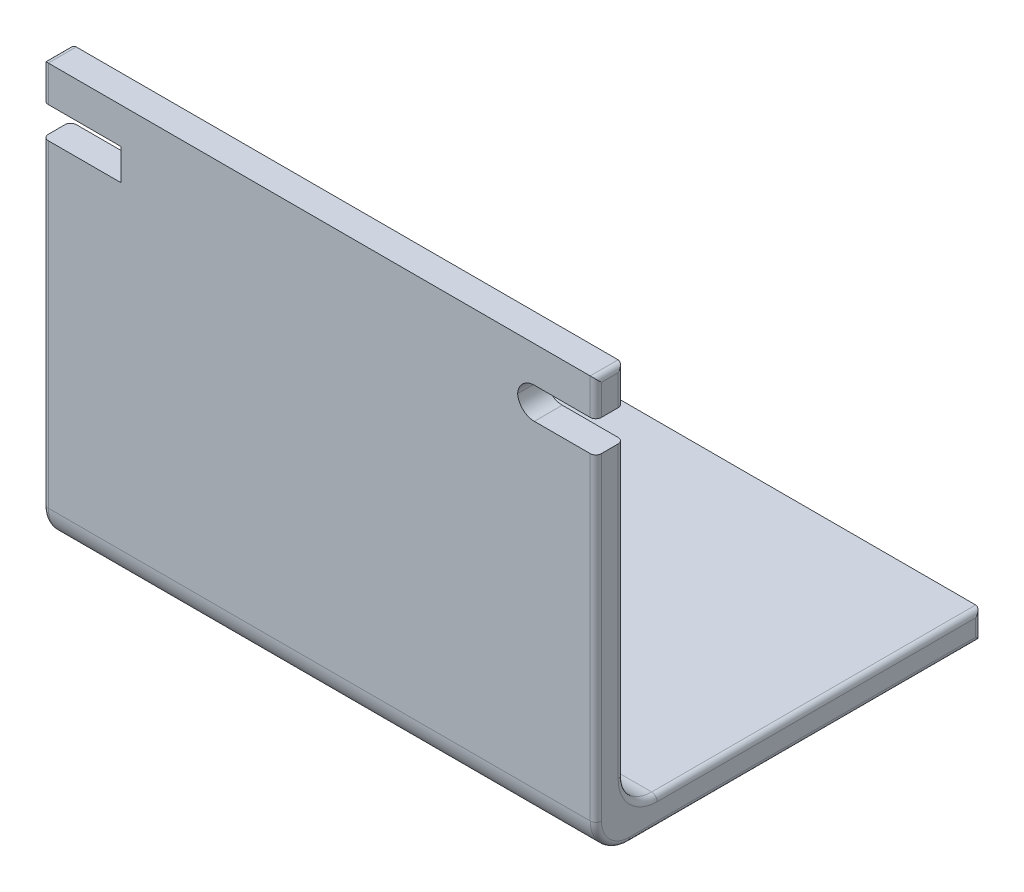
ISO-10303-21;
HEADER;
FILE_DESCRIPTION(('STEP AP214'),'2;1');
FILE_NAME('part.step','',(''),(''),'','','');
FILE_SCHEMA(('AUTOMOTIVE_DESIGN { 1 0 10303 214 1 1 1 1 }'));
ENDSEC;
DATA;
#1=APPLICATION_CONTEXT('core data for automotive mechanical design processes');
#2=APPLICATION_PROTOCOL_DEFINITION('international standard','automotive_design',2000,#1);
#3=PRODUCT_CONTEXT('',#1,'mechanical');
#4=PRODUCT('Part','Part','',(#3));
#5=PRODUCT_RELATED_PRODUCT_CATEGORY('part','',(#4));
#6=PRODUCT_DEFINITION_FORMATION('','',#4);
#7=PRODUCT_DEFINITION_CONTEXT('part definition',#1,'design');
#8=PRODUCT_DEFINITION('design','',#6,#7);
#9=PRODUCT_DEFINITION_SHAPE('','',#8);
#10=(LENGTH_UNIT() NAMED_UNIT(*) SI_UNIT(.MILLI.,.METRE.));
#11=(NAMED_UNIT(*) PLANE_ANGLE_UNIT() SI_UNIT($,.RADIAN.));
#12=(NAMED_UNIT(*) SI_UNIT($,.STERADIAN.) SOLID_ANGLE_UNIT());
#13=UNCERTAINTY_MEASURE_WITH_UNIT(LENGTH_MEASURE(1.E-05),#10,'distance_accuracy_value','');
#14=(GEOMETRIC_REPRESENTATION_CONTEXT(3) GLOBAL_UNCERTAINTY_ASSIGNED_CONTEXT((#13)) GLOBAL_UNIT_ASSIGNED_CONTEXT((#10,
#11,#12)) REPRESENTATION_CONTEXT('',''));
#15=CARTESIAN_POINT('',(0.,0.,0.));
#16=DIRECTION('',(0.,0.,1.));
#17=DIRECTION('',(1.,0.,0.));
#18=AXIS2_PLACEMENT_3D('',#15,#16,#17);
#19=CARTESIAN_POINT('',(49.5,0.,0.));
#20=DIRECTION('',(0.,0.,-1.));
#21=DIRECTION('',(0.,1.,0.));
#22=AXIS2_PLACEMENT_3D('',#19,#20,#21);
#23=PLANE('',#22);
#24=DIRECTION('',(-1.,0.,0.));
#25=VECTOR('',#24,1.);
#26=CARTESIAN_POINT('',(7.,-6.02,0.));
#27=LINE('',#26,#25);
#28=CARTESIAN_POINT('',(7.,-6.02,0.));
#29=VERTEX_POINT('',#28);
#30=CARTESIAN_POINT('',(0.5,-6.02,0.));
#31=VERTEX_POINT('',#30);
#32=EDGE_CURVE('E258',#29,#31,#27,.T.);
#33=ORIENTED_EDGE('',*,*,#32,.T.);
#34=DIRECTION('',(0.,-1.,0.));
#35=VECTOR('',#34,1.);
#36=CARTESIAN_POINT('',(0.5,0.,0.));
#37=LINE('',#36,#35);
#38=CARTESIAN_POINT('',(0.5,-34.5,0.));
#39=VERTEX_POINT('',#38);
#40=EDGE_CURVE('E354',#31,#39,#37,.T.);
#41=ORIENTED_EDGE('',*,*,#40,.T.);
#42=DIRECTION('',(-1.,0.,0.));
#43=VECTOR('',#42,1.);
#44=CARTESIAN_POINT('',(49.5,-34.5,0.));
#45=LINE('',#44,#43);
#46=CARTESIAN_POINT('',(49.,-34.5,0.));
#47=VERTEX_POINT('',#46);
#48=EDGE_CURVE('E300',#39,#47,#45,.F.);
#49=ORIENTED_EDGE('',*,*,#48,.T.);
#50=DIRECTION('',(0.,-1.,0.));
#51=VECTOR('',#50,1.);
#52=CARTESIAN_POINT('',(49.,0.,0.));
#53=LINE('',#52,#51);
#54=CARTESIAN_POINT('',(49.,-6.02,0.));
#55=VERTEX_POINT('',#54);
#56=EDGE_CURVE('E351',#47,#55,#53,.F.);
#57=ORIENTED_EDGE('',*,*,#56,.T.);
#58=DIRECTION('',(1.,0.,0.));
#59=VECTOR('',#58,1.);
#60=CARTESIAN_POINT('',(42.5,-6.02,0.));
#61=LINE('',#60,#59);
#62=CARTESIAN_POINT('',(44.,-6.02,0.));
#63=VERTEX_POINT('',#62);
#64=EDGE_CURVE('E265',#63,#55,#61,.T.);
#65=ORIENTED_EDGE('',*,*,#64,.F.);
#66=CARTESIAN_POINT('',(44.,-4.52,0.));
#67=DIRECTION('',(0.,0.,-1.));
#68=DIRECTION('',(0.,1.,0.));
#69=AXIS2_PLACEMENT_3D('',#66,#67,#68);
#70=CIRCLE('',#69,1.5);
#71=CARTESIAN_POINT('',(42.5033370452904,-4.62,0.));
#72=VERTEX_POINT('',#71);
#73=EDGE_CURVE('E50',#63,#72,#70,.T.);
#74=ORIENTED_EDGE('',*,*,#73,.T.);
#75=CARTESIAN_POINT('',(44.,-4.72,0.));
#76=DIRECTION('',(0.,0.,-1.));
#77=DIRECTION('',(0.,1.,0.));
#78=AXIS2_PLACEMENT_3D('',#75,#76,#77);
#79=CIRCLE('',#78,1.5);
#80=CARTESIAN_POINT('',(44.,-3.22,0.));
#81=VERTEX_POINT('',#80);
#82=EDGE_CURVE('E43',#72,#81,#79,.T.);
#83=ORIENTED_EDGE('',*,*,#82,.T.);
#84=DIRECTION('',(1.,0.,0.));
#85=VECTOR('',#84,1.);
#86=CARTESIAN_POINT('',(42.5,-3.22,0.));
#87=LINE('',#86,#85);
#88=CARTESIAN_POINT('',(49.,-3.22,0.));
#89=VERTEX_POINT('',#88);
#90=EDGE_CURVE('E266',#81,#89,#87,.T.);
#91=ORIENTED_EDGE('',*,*,#90,.T.);
#92=CARTESIAN_POINT('',(49.,0.,0.));
#93=VERTEX_POINT('',#92);
#94=EDGE_CURVE('E350',#89,#93,#53,.F.);
#95=ORIENTED_EDGE('',*,*,#94,.T.);
#96=DIRECTION('',(-1.,0.,0.));
#97=VECTOR('',#96,1.);
#98=CARTESIAN_POINT('',(49.5,0.,0.));
#99=LINE('',#98,#97);
#100=CARTESIAN_POINT('',(0.5,0.,0.));
#101=VERTEX_POINT('',#100);
#102=EDGE_CURVE('E289',#93,#101,#99,.T.);
#103=ORIENTED_EDGE('',*,*,#102,.T.);
#104=CARTESIAN_POINT('',(0.5,-3.22,0.));
#105=VERTEX_POINT('',#104);
#106=EDGE_CURVE('E248',#101,#105,#37,.T.);
#107=ORIENTED_EDGE('',*,*,#106,.T.);
#108=DIRECTION('',(-1.,0.,0.));
#109=VECTOR('',#108,1.);
#110=CARTESIAN_POINT('',(7.,-3.22,0.));
#111=LINE('',#110,#109);
#112=CARTESIAN_POINT('',(7.,-3.22,0.));
#113=VERTEX_POINT('',#112);
#114=EDGE_CURVE('E228',#113,#105,#111,.T.);
#115=ORIENTED_EDGE('',*,*,#114,.F.);
#116=DIRECTION('',(0.,-1.,0.));
#117=VECTOR('',#116,1.);
#118=CARTESIAN_POINT('',(7.,-3.22,0.));
#119=LINE('',#118,#117);
#120=EDGE_CURVE('E236',#113,#29,#119,.T.);
#121=ORIENTED_EDGE('',*,*,#120,.T.);
#122=EDGE_LOOP('',(#33,#41,#49,#57,#65,#74,#83,#91,#95,#103,#107,#115,#121));
#123=FACE_BOUND('',#122,.T.);
#124=ADVANCED_FACE('F34',(#123),#23,.F.);
#125=CARTESIAN_POINT('',(49.5,-35.,-2.5));
#126=DIRECTION('',(0.,0.,1.));
#127=DIRECTION('',(1.,0.,0.));
#128=AXIS2_PLACEMENT_3D('',#125,#126,#127);
#129=PLANE('',#128);
#130=DIRECTION('',(-1.,0.,0.));
#131=VECTOR('',#130,1.);
#132=CARTESIAN_POINT('',(7.,-6.02,-2.5));
#133=LINE('',#132,#131);
#134=CARTESIAN_POINT('',(7.,-6.02,-2.5));
#135=VERTEX_POINT('',#134);
#136=CARTESIAN_POINT('',(0.5,-6.02,-2.5));
#137=VERTEX_POINT('',#136);
#138=EDGE_CURVE('E250',#135,#137,#133,.T.);
#139=ORIENTED_EDGE('',*,*,#138,.F.);
#140=DIRECTION('',(0.,1.,0.));
#141=VECTOR('',#140,1.);
#142=CARTESIAN_POINT('',(7.,-3.22,-2.5));
#143=LINE('',#142,#141);
#144=CARTESIAN_POINT('',(7.,-3.22,-2.5));
#145=VERTEX_POINT('',#144);
#146=EDGE_CURVE('E235',#135,#145,#143,.T.);
#147=ORIENTED_EDGE('',*,*,#146,.T.);
#148=DIRECTION('',(-1.,0.,0.));
#149=VECTOR('',#148,1.);
#150=CARTESIAN_POINT('',(7.,-3.22,-2.5));
#151=LINE('',#150,#149);
#152=CARTESIAN_POINT('',(0.5,-3.22,-2.5));
#153=VERTEX_POINT('',#152);
#154=EDGE_CURVE('E231',#145,#153,#151,.T.);
#155=ORIENTED_EDGE('',*,*,#154,.T.);
#156=DIRECTION('',(0.,1.,0.));
#157=VECTOR('',#156,1.);
#158=CARTESIAN_POINT('',(0.5,-35.,-2.5));
#159=LINE('',#158,#157);
#160=CARTESIAN_POINT('',(0.5,0.,-2.5));
#161=VERTEX_POINT('',#160);
#162=EDGE_CURVE('E341',#153,#161,#159,.T.);
#163=ORIENTED_EDGE('',*,*,#162,.T.);
#164=DIRECTION('',(-1.,0.,0.));
#165=VECTOR('',#164,1.);
#166=CARTESIAN_POINT('',(49.5,0.,-2.5));
#167=LINE('',#166,#165);
#168=CARTESIAN_POINT('',(49.,0.,-2.5));
#169=VERTEX_POINT('',#168);
#170=EDGE_CURVE('E279',#169,#161,#167,.T.);
#171=ORIENTED_EDGE('',*,*,#170,.F.);
#172=DIRECTION('',(0.,1.,0.));
#173=VECTOR('',#172,1.);
#174=CARTESIAN_POINT('',(49.,-32.,-2.5));
#175=LINE('',#174,#173);
#176=CARTESIAN_POINT('',(49.,-3.22,-2.5));
#177=VERTEX_POINT('',#176);
#178=EDGE_CURVE('E338',#169,#177,#175,.F.);
#179=ORIENTED_EDGE('',*,*,#178,.T.);
#180=DIRECTION('',(1.,0.,0.));
#181=VECTOR('',#180,1.);
#182=CARTESIAN_POINT('',(42.5,-3.22,-2.5));
#183=LINE('',#182,#181);
#184=CARTESIAN_POINT('',(44.,-3.22,-2.5));
#185=VERTEX_POINT('',#184);
#186=EDGE_CURVE('E269',#185,#177,#183,.T.);
#187=ORIENTED_EDGE('',*,*,#186,.F.);
#188=CARTESIAN_POINT('',(44.,-4.72,-2.5));
#189=DIRECTION('',(0.,0.,1.));
#190=DIRECTION('',(1.,0.,0.));
#191=AXIS2_PLACEMENT_3D('',#188,#189,#190);
#192=CIRCLE('',#191,1.5);
#193=CARTESIAN_POINT('',(42.5033370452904,-4.62,-2.5));
#194=VERTEX_POINT('',#193);
#195=EDGE_CURVE('E11',#185,#194,#192,.T.);
#196=ORIENTED_EDGE('',*,*,#195,.T.);
#197=CARTESIAN_POINT('',(44.,-4.52,-2.5));
#198=DIRECTION('',(0.,0.,1.));
#199=DIRECTION('',(1.,0.,0.));
#200=AXIS2_PLACEMENT_3D('',#197,#198,#199);
#201=CIRCLE('',#200,1.5);
#202=CARTESIAN_POINT('',(44.,-6.02,-2.5));
#203=VERTEX_POINT('',#202);
#204=EDGE_CURVE('E443',#194,#203,#201,.T.);
#205=ORIENTED_EDGE('',*,*,#204,.T.);
#206=DIRECTION('',(1.,0.,0.));
#207=VECTOR('',#206,1.);
#208=CARTESIAN_POINT('',(42.5,-6.02,-2.5));
#209=LINE('',#208,#207);
#210=CARTESIAN_POINT('',(49.,-6.02,-2.5));
#211=VERTEX_POINT('',#210);
#212=EDGE_CURVE('E271',#203,#211,#209,.T.);
#213=ORIENTED_EDGE('',*,*,#212,.T.);
#214=CARTESIAN_POINT('',(49.,-32.,-2.5));
#215=VERTEX_POINT('',#214);
#216=EDGE_CURVE('E337',#211,#215,#175,.F.);
#217=ORIENTED_EDGE('',*,*,#216,.T.);
#218=DIRECTION('',(-1.,0.,0.));
#219=VECTOR('',#218,1.);
#220=CARTESIAN_POINT('',(0.,-32.,-2.5));
#221=LINE('',#220,#219);
#222=CARTESIAN_POINT('',(0.5,-32.,-2.5));
#223=VERTEX_POINT('',#222);
#224=EDGE_CURVE('E291',#215,#223,#221,.T.);
#225=ORIENTED_EDGE('',*,*,#224,.T.);
#226=EDGE_CURVE('E342',#223,#137,#159,.T.);
#227=ORIENTED_EDGE('',*,*,#226,.T.);
#228=EDGE_LOOP('',(#139,#147,#155,#163,#171,#179,#187,#196,#205,#213,#217,#225,#227));
#229=FACE_BOUND('',#228,.T.);
#230=ADVANCED_FACE('F461',(#229),#129,.F.);
#231=CARTESIAN_POINT('',(0.,0.,0.));
#232=DIRECTION('',(1.,0.,0.));
#233=DIRECTION('',(0.,0.,-1.));
#234=AXIS2_PLACEMENT_3D('',#231,#232,#233);
#235=PLANE('',#234);
#236=DIRECTION('',(0.,0.,-1.));
#237=VECTOR('',#236,1.);
#238=CARTESIAN_POINT('',(0.,-6.02,0.));
#239=LINE('',#238,#237);
#240=CARTESIAN_POINT('',(0.,-6.02,-0.500000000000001));
#241=VERTEX_POINT('',#240);
#242=CARTESIAN_POINT('',(0.,-6.02,-2.));
#243=VERTEX_POINT('',#242);
#244=EDGE_CURVE('E243',#241,#243,#239,.T.);
#245=ORIENTED_EDGE('',*,*,#244,.T.);
#246=DIRECTION('',(0.,1.,0.));
#247=VECTOR('',#246,1.);
#248=CARTESIAN_POINT('',(0.,0.,-2.));
#249=LINE('',#248,#247);
#250=CARTESIAN_POINT('',(0.,-32.,-2.));
#251=VERTEX_POINT('',#250);
#252=EDGE_CURVE('E318',#243,#251,#249,.F.);
#253=ORIENTED_EDGE('',*,*,#252,.T.);
#254=CARTESIAN_POINT('',(0.,-32.,-5.5));
#255=DIRECTION('',(1.,0.,0.));
#256=DIRECTION('',(0.,0.,-1.));
#257=AXIS2_PLACEMENT_3D('',#254,#255,#256);
#258=CIRCLE('',#257,3.5);
#259=CARTESIAN_POINT('',(0.,-35.5,-5.5));
#260=VERTEX_POINT('',#259);
#261=EDGE_CURVE('E322',#251,#260,#258,.T.);
#262=ORIENTED_EDGE('',*,*,#261,.T.);
#263=DIRECTION('',(0.,0.,1.));
#264=VECTOR('',#263,1.);
#265=CARTESIAN_POINT('',(0.,-35.5,0.));
#266=LINE('',#265,#264);
#267=CARTESIAN_POINT('',(0.,-35.5,-34.));
#268=VERTEX_POINT('',#267);
#269=EDGE_CURVE('E324',#260,#268,#266,.F.);
#270=ORIENTED_EDGE('',*,*,#269,.T.);
#271=DIRECTION('',(0.,1.,0.));
#272=VECTOR('',#271,1.);
#273=CARTESIAN_POINT('',(0.,0.,-34.));
#274=LINE('',#273,#272);
#275=CARTESIAN_POINT('',(0.,-37.,-34.));
#276=VERTEX_POINT('',#275);
#277=EDGE_CURVE('E326',#268,#276,#274,.F.);
#278=ORIENTED_EDGE('',*,*,#277,.T.);
#279=DIRECTION('',(0.,0.,-1.));
#280=VECTOR('',#279,1.);
#281=CARTESIAN_POINT('',(0.,-37.,0.));
#282=LINE('',#281,#280);
#283=CARTESIAN_POINT('',(0.,-37.,-3.));
#284=VERTEX_POINT('',#283);
#285=EDGE_CURVE('E308',#276,#284,#282,.F.);
#286=ORIENTED_EDGE('',*,*,#285,.T.);
#287=CARTESIAN_POINT('',(0.,-34.5,-3.));
#288=DIRECTION('',(1.,0.,0.));
#289=DIRECTION('',(0.,0.,-1.));
#290=AXIS2_PLACEMENT_3D('',#287,#288,#289);
#291=CIRCLE('',#290,2.5);
#292=CARTESIAN_POINT('',(0.,-34.5,-0.500000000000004));
#293=VERTEX_POINT('',#292);
#294=EDGE_CURVE('E310',#284,#293,#291,.F.);
#295=ORIENTED_EDGE('',*,*,#294,.T.);
#296=DIRECTION('',(0.,-1.,0.));
#297=VECTOR('',#296,1.);
#298=CARTESIAN_POINT('',(0.,0.,-0.5));
#299=LINE('',#298,#297);
#300=EDGE_CURVE('E313',#293,#241,#299,.F.);
#301=ORIENTED_EDGE('',*,*,#300,.T.);
#302=EDGE_LOOP('',(#245,#253,#262,#270,#278,#286,#295,#301));
#303=FACE_BOUND('',#302,.T.);
#304=ADVANCED_FACE('F600',(#303),#235,.F.);
#305=DIRECTION('',(0.,0.,1.));
#306=VECTOR('',#305,1.);
#307=CARTESIAN_POINT('',(0.,-3.22,0.));
#308=LINE('',#307,#306);
#309=CARTESIAN_POINT('',(0.,-3.22,-2.));
#310=VERTEX_POINT('',#309);
#311=CARTESIAN_POINT('',(0.,-3.22,-0.500000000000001));
#312=VERTEX_POINT('',#311);
#313=EDGE_CURVE('E456',#310,#312,#308,.T.);
#314=ORIENTED_EDGE('',*,*,#313,.T.);
#315=CARTESIAN_POINT('',(0.,-0.5,-0.5));
#316=VERTEX_POINT('',#315);
#317=EDGE_CURVE('E312',#312,#316,#299,.F.);
#318=ORIENTED_EDGE('',*,*,#317,.T.);
#319=DIRECTION('',(0.,0.,1.));
#320=VECTOR('',#319,1.);
#321=CARTESIAN_POINT('',(0.,-0.5,0.));
#322=LINE('',#321,#320);
#323=CARTESIAN_POINT('',(0.,-0.5,-2.));
#324=VERTEX_POINT('',#323);
#325=EDGE_CURVE('E316',#316,#324,#322,.F.);
#326=ORIENTED_EDGE('',*,*,#325,.T.);
#327=EDGE_CURVE('E319',#324,#310,#249,.F.);
#328=ORIENTED_EDGE('',*,*,#327,.T.);
#329=EDGE_LOOP('',(#314,#318,#326,#328));
#330=FACE_BOUND('',#329,.T.);
#331=ADVANCED_FACE('F547',(#330),#235,.F.);
#332=CARTESIAN_POINT('',(0.5,0.,-0.5));
#333=DIRECTION('',(0.,-1.,0.));
#334=DIRECTION('',(0.,0.,-1.));
#335=AXIS2_PLACEMENT_3D('',#332,#333,#334);
#336=CYLINDRICAL_SURFACE('',#335,0.5);
#337=ORIENTED_EDGE('',*,*,#40,.F.);
#338=CARTESIAN_POINT('',(0.5,-6.02,-0.500000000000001));
#339=DIRECTION('',(0.,1.,0.));
#340=DIRECTION('',(0.,0.,1.));
#341=AXIS2_PLACEMENT_3D('',#338,#339,#340);
#342=CIRCLE('',#341,0.5);
#343=EDGE_CURVE('E257',#31,#241,#342,.F.);
#344=ORIENTED_EDGE('',*,*,#343,.T.);
#345=ORIENTED_EDGE('',*,*,#300,.F.);
#346=CARTESIAN_POINT('',(0.5,-34.5,-0.500000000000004));
#347=DIRECTION('',(0.,-1.,0.));
#348=DIRECTION('',(0.,0.,-1.));
#349=AXIS2_PLACEMENT_3D('',#346,#347,#348);
#350=CIRCLE('',#349,0.5);
#351=EDGE_CURVE('E400',#39,#293,#350,.T.);
#352=ORIENTED_EDGE('',*,*,#351,.F.);
#353=EDGE_LOOP('',(#337,#344,#345,#352));
#354=FACE_BOUND('',#353,.T.);
#355=ADVANCED_FACE('F623',(#354),#336,.T.);
#356=ORIENTED_EDGE('',*,*,#317,.F.);
#357=CARTESIAN_POINT('',(0.5,-3.22,-0.5));
#358=DIRECTION('',(0.,-1.,0.));
#359=DIRECTION('',(0.,0.,-1.));
#360=AXIS2_PLACEMENT_3D('',#357,#358,#359);
#361=CIRCLE('',#360,0.5);
#362=EDGE_CURVE('E255',#312,#105,#361,.F.);
#363=ORIENTED_EDGE('',*,*,#362,.T.);
#364=ORIENTED_EDGE('',*,*,#106,.F.);
#365=CARTESIAN_POINT('',(0.5,-0.5,-0.5));
#366=DIRECTION('',(0.,-0.707106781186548,0.707106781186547));
#367=DIRECTION('',(0.,-0.707106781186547,-0.707106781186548));
#368=AXIS2_PLACEMENT_3D('',#365,#366,#367);
#369=ELLIPSE('',#368,0.707106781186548,0.5);
#370=EDGE_CURVE('E283',#101,#316,#369,.T.);
#371=ORIENTED_EDGE('',*,*,#370,.T.);
#372=EDGE_LOOP('',(#356,#363,#364,#371));
#373=FACE_BOUND('',#372,.T.);
#374=ADVANCED_FACE('F551',(#373),#336,.T.);
#375=CARTESIAN_POINT('',(0.5,-35.,-2.));
#376=DIRECTION('',(0.,1.,0.));
#377=DIRECTION('',(0.,0.,1.));
#378=AXIS2_PLACEMENT_3D('',#375,#376,#377);
#379=CYLINDRICAL_SURFACE('',#378,0.5);
#380=ORIENTED_EDGE('',*,*,#252,.F.);
#381=CARTESIAN_POINT('',(0.5,-6.02,-2.));
#382=DIRECTION('',(0.,1.,0.));
#383=DIRECTION('',(0.,0.,1.));
#384=AXIS2_PLACEMENT_3D('',#381,#382,#383);
#385=CIRCLE('',#384,0.5);
#386=EDGE_CURVE('E435',#243,#137,#385,.F.);
#387=ORIENTED_EDGE('',*,*,#386,.T.);
#388=ORIENTED_EDGE('',*,*,#226,.F.);
#389=CARTESIAN_POINT('',(0.5,-32.,-2.));
#390=DIRECTION('',(0.,-1.,0.));
#391=DIRECTION('',(0.,0.,-1.));
#392=AXIS2_PLACEMENT_3D('',#389,#390,#391);
#393=CIRCLE('',#392,0.5);
#394=EDGE_CURVE('E397',#251,#223,#393,.T.);
#395=ORIENTED_EDGE('',*,*,#394,.F.);
#396=EDGE_LOOP('',(#380,#387,#388,#395));
#397=FACE_BOUND('',#396,.T.);
#398=ADVANCED_FACE('F537',(#397),#379,.T.);
#399=ORIENTED_EDGE('',*,*,#162,.F.);
#400=CARTESIAN_POINT('',(0.5,-3.22,-2.));
#401=DIRECTION('',(0.,-1.,0.));
#402=DIRECTION('',(0.,0.,-1.));
#403=AXIS2_PLACEMENT_3D('',#400,#401,#402);
#404=CIRCLE('',#403,0.5);
#405=EDGE_CURVE('E432',#153,#310,#404,.F.);
#406=ORIENTED_EDGE('',*,*,#405,.T.);
#407=ORIENTED_EDGE('',*,*,#327,.F.);
#408=CARTESIAN_POINT('',(0.5,-0.5,-2.));
#409=DIRECTION('',(0.,0.707106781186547,0.707106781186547));
#410=DIRECTION('',(0.,-0.707106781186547,0.707106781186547));
#411=AXIS2_PLACEMENT_3D('',#408,#409,#410);
#412=ELLIPSE('',#411,0.707106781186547,0.5);
#413=EDGE_CURVE('E403',#324,#161,#412,.F.);
#414=ORIENTED_EDGE('',*,*,#413,.T.);
#415=EDGE_LOOP('',(#399,#406,#407,#414));
#416=FACE_BOUND('',#415,.T.);
#417=ADVANCED_FACE('F559',(#416),#379,.T.);
#418=CARTESIAN_POINT('',(49.5,0.,0.));
#419=DIRECTION('',(1.,0.,0.));
#420=DIRECTION('',(0.,0.,-1.));
#421=AXIS2_PLACEMENT_3D('',#418,#419,#420);
#422=PLANE('',#421);
#423=DIRECTION('',(0.,0.,1.));
#424=VECTOR('',#423,1.);
#425=CARTESIAN_POINT('',(49.5,-3.22,0.));
#426=LINE('',#425,#424);
#427=CARTESIAN_POINT('',(49.5,-3.22,-2.));
#428=VERTEX_POINT('',#427);
#429=CARTESIAN_POINT('',(49.5,-3.22,-0.500000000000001));
#430=VERTEX_POINT('',#429);
#431=EDGE_CURVE('E263',#428,#430,#426,.T.);
#432=ORIENTED_EDGE('',*,*,#431,.F.);
#433=DIRECTION('',(0.,1.,0.));
#434=VECTOR('',#433,1.);
#435=CARTESIAN_POINT('',(49.5,0.,-2.));
#436=LINE('',#435,#434);
#437=CARTESIAN_POINT('',(49.5,-0.5,-2.));
#438=VERTEX_POINT('',#437);
#439=EDGE_CURVE('E378',#428,#438,#436,.T.);
#440=ORIENTED_EDGE('',*,*,#439,.T.);
#441=DIRECTION('',(0.,0.,1.));
#442=VECTOR('',#441,1.);
#443=CARTESIAN_POINT('',(49.5,-0.5,0.));
#444=LINE('',#443,#442);
#445=CARTESIAN_POINT('',(49.5,-0.5,-0.5));
#446=VERTEX_POINT('',#445);
#447=EDGE_CURVE('E382',#438,#446,#444,.T.);
#448=ORIENTED_EDGE('',*,*,#447,.T.);
#449=DIRECTION('',(0.,-1.,0.));
#450=VECTOR('',#449,1.);
#451=CARTESIAN_POINT('',(49.5,-34.5,-0.500000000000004));
#452=LINE('',#451,#450);
#453=EDGE_CURVE('E365',#446,#430,#452,.T.);
#454=ORIENTED_EDGE('',*,*,#453,.T.);
#455=EDGE_LOOP('',(#432,#440,#448,#454));
#456=FACE_BOUND('',#455,.T.);
#457=ADVANCED_FACE('F576',(#456),#422,.T.);
#458=CARTESIAN_POINT('',(49.,0.,-2.));
#459=DIRECTION('',(0.,-1.,0.));
#460=DIRECTION('',(0.,0.,-1.));
#461=AXIS2_PLACEMENT_3D('',#458,#459,#460);
#462=CYLINDRICAL_SURFACE('',#461,0.5);
#463=CARTESIAN_POINT('',(49.,-3.22,-2.));
#464=DIRECTION('',(0.,1.,0.));
#465=DIRECTION('',(0.,0.,1.));
#466=AXIS2_PLACEMENT_3D('',#463,#464,#465);
#467=CIRCLE('',#466,0.5);
#468=EDGE_CURVE('E276',#177,#428,#467,.F.);
#469=ORIENTED_EDGE('',*,*,#468,.F.);
#470=ORIENTED_EDGE('',*,*,#178,.F.);
#471=CARTESIAN_POINT('',(49.,-0.5,-2.));
#472=DIRECTION('',(0.,-0.707106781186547,-0.707106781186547));
#473=DIRECTION('',(0.,-0.707106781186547,0.707106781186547));
#474=AXIS2_PLACEMENT_3D('',#471,#472,#473);
#475=ELLIPSE('',#474,0.707106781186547,0.5);
#476=EDGE_CURVE('E409',#438,#169,#475,.F.);
#477=ORIENTED_EDGE('',*,*,#476,.F.);
#478=ORIENTED_EDGE('',*,*,#439,.F.);
#479=EDGE_LOOP('',(#469,#470,#477,#478));
#480=FACE_BOUND('',#479,.T.);
#481=ADVANCED_FACE('F580',(#480),#462,.T.);
#482=CARTESIAN_POINT('',(49.,0.,-0.5));
#483=DIRECTION('',(0.,1.,0.));
#484=DIRECTION('',(0.,0.,1.));
#485=AXIS2_PLACEMENT_3D('',#482,#483,#484);
#486=CYLINDRICAL_SURFACE('',#485,0.5);
#487=CARTESIAN_POINT('',(49.,-3.22,-0.5));
#488=DIRECTION('',(0.,1.,0.));
#489=DIRECTION('',(0.,0.,1.));
#490=AXIS2_PLACEMENT_3D('',#487,#488,#489);
#491=CIRCLE('',#490,0.5);
#492=EDGE_CURVE('E429',#430,#89,#491,.F.);
#493=ORIENTED_EDGE('',*,*,#492,.F.);
#494=ORIENTED_EDGE('',*,*,#453,.F.);
#495=CARTESIAN_POINT('',(49.,-0.5,-0.5));
#496=DIRECTION('',(0.,0.707106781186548,-0.707106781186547));
#497=DIRECTION('',(0.,0.707106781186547,0.707106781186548));
#498=AXIS2_PLACEMENT_3D('',#495,#496,#497);
#499=ELLIPSE('',#498,0.707106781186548,0.5);
#500=EDGE_CURVE('E278',#93,#446,#499,.T.);
#501=ORIENTED_EDGE('',*,*,#500,.F.);
#502=ORIENTED_EDGE('',*,*,#94,.F.);
#503=EDGE_LOOP('',(#493,#494,#501,#502));
#504=FACE_BOUND('',#503,.T.);
#505=ADVANCED_FACE('F573',(#504),#486,.T.);
#506=CARTESIAN_POINT('',(49.5,0.,-2.5));
#507=DIRECTION('',(0.,-1.,0.));
#508=DIRECTION('',(0.,0.,-1.));
#509=AXIS2_PLACEMENT_3D('',#506,#507,#508);
#510=PLANE('',#509);
#511=ORIENTED_EDGE('',*,*,#170,.T.);
#512=DIRECTION('',(0.,0.,1.));
#513=VECTOR('',#512,1.);
#514=CARTESIAN_POINT('',(0.5,0.,-2.5));
#515=LINE('',#514,#513);
#516=EDGE_CURVE('E348',#161,#101,#515,.T.);
#517=ORIENTED_EDGE('',*,*,#516,.T.);
#518=ORIENTED_EDGE('',*,*,#102,.F.);
#519=DIRECTION('',(0.,0.,1.));
#520=VECTOR('',#519,1.);
#521=CARTESIAN_POINT('',(49.,0.,-2.5));
#522=LINE('',#521,#520);
#523=EDGE_CURVE('E345',#93,#169,#522,.F.);
#524=ORIENTED_EDGE('',*,*,#523,.T.);
#525=EDGE_LOOP('',(#511,#517,#518,#524));
#526=FACE_BOUND('',#525,.T.);
#527=ADVANCED_FACE('F562',(#526),#510,.F.);
#528=CARTESIAN_POINT('',(49.5,-37.5,0.));
#529=DIRECTION('',(0.,1.,0.));
#530=DIRECTION('',(0.,0.,1.));
#531=AXIS2_PLACEMENT_3D('',#528,#529,#530);
#532=PLANE('',#531);
#533=DIRECTION('',(-1.,0.,0.));
#534=VECTOR('',#533,1.);
#535=CARTESIAN_POINT('',(49.5,-37.5,-3.));
#536=LINE('',#535,#534);
#537=CARTESIAN_POINT('',(49.,-37.5,-3.));
#538=VERTEX_POINT('',#537);
#539=CARTESIAN_POINT('',(0.5,-37.5,-3.));
#540=VERTEX_POINT('',#539);
#541=EDGE_CURVE('E297',#538,#540,#536,.T.);
#542=ORIENTED_EDGE('',*,*,#541,.T.);
#543=DIRECTION('',(0.,0.,-1.));
#544=VECTOR('',#543,1.);
#545=CARTESIAN_POINT('',(0.5,-37.5,0.));
#546=LINE('',#545,#544);
#547=CARTESIAN_POINT('',(0.5,-37.5,-34.5));
#548=VERTEX_POINT('',#547);
#549=EDGE_CURVE('E362',#540,#548,#546,.T.);
#550=ORIENTED_EDGE('',*,*,#549,.T.);
#551=DIRECTION('',(-1.,0.,0.));
#552=VECTOR('',#551,1.);
#553=CARTESIAN_POINT('',(49.5,-37.5,-34.5));
#554=LINE('',#553,#552);
#555=CARTESIAN_POINT('',(49.,-37.5,-34.5));
#556=VERTEX_POINT('',#555);
#557=EDGE_CURVE('E286',#556,#548,#554,.T.);
#558=ORIENTED_EDGE('',*,*,#557,.F.);
#559=DIRECTION('',(0.,0.,-1.));
#560=VECTOR('',#559,1.);
#561=CARTESIAN_POINT('',(49.,-37.5,-3.));
#562=LINE('',#561,#560);
#563=EDGE_CURVE('E360',#556,#538,#562,.F.);
#564=ORIENTED_EDGE('',*,*,#563,.T.);
#565=EDGE_LOOP('',(#542,#550,#558,#564));
#566=FACE_BOUND('',#565,.T.);
#567=ADVANCED_FACE('F507',(#566),#532,.F.);
#568=CARTESIAN_POINT('',(49.5,-37.5,-34.5));
#569=DIRECTION('',(0.,0.,1.));
#570=DIRECTION('',(1.,0.,0.));
#571=AXIS2_PLACEMENT_3D('',#568,#569,#570);
#572=PLANE('',#571);
#573=ORIENTED_EDGE('',*,*,#557,.T.);
#574=DIRECTION('',(0.,1.,0.));
#575=VECTOR('',#574,1.);
#576=CARTESIAN_POINT('',(0.5,-37.5,-34.5));
#577=LINE('',#576,#575);
#578=CARTESIAN_POINT('',(0.5,-35.,-34.5));
#579=VERTEX_POINT('',#578);
#580=EDGE_CURVE('E305',#548,#579,#577,.T.);
#581=ORIENTED_EDGE('',*,*,#580,.T.);
#582=DIRECTION('',(-1.,0.,0.));
#583=VECTOR('',#582,1.);
#584=CARTESIAN_POINT('',(49.5,-35.,-34.5));
#585=LINE('',#584,#583);
#586=CARTESIAN_POINT('',(49.,-35.,-34.5));
#587=VERTEX_POINT('',#586);
#588=EDGE_CURVE('E282',#587,#579,#585,.T.);
#589=ORIENTED_EDGE('',*,*,#588,.F.);
#590=DIRECTION('',(0.,1.,0.));
#591=VECTOR('',#590,1.);
#592=CARTESIAN_POINT('',(49.,-37.5,-34.5));
#593=LINE('',#592,#591);
#594=EDGE_CURVE('E303',#587,#556,#593,.F.);
#595=ORIENTED_EDGE('',*,*,#594,.T.);
#596=EDGE_LOOP('',(#573,#581,#589,#595));
#597=FACE_BOUND('',#596,.T.);
#598=ADVANCED_FACE('F492',(#597),#572,.F.);
#599=CARTESIAN_POINT('',(49.5,-35.,-34.5));
#600=DIRECTION('',(0.,-1.,0.));
#601=DIRECTION('',(0.,0.,-1.));
#602=AXIS2_PLACEMENT_3D('',#599,#600,#601);
#603=PLANE('',#602);
#604=ORIENTED_EDGE('',*,*,#588,.T.);
#605=DIRECTION('',(0.,0.,1.));
#606=VECTOR('',#605,1.);
#607=CARTESIAN_POINT('',(0.5,-35.,-34.5));
#608=LINE('',#607,#606);
#609=CARTESIAN_POINT('',(0.5,-35.,-5.5));
#610=VERTEX_POINT('',#609);
#611=EDGE_CURVE('E331',#579,#610,#608,.T.);
#612=ORIENTED_EDGE('',*,*,#611,.T.);
#613=DIRECTION('',(-1.,0.,0.));
#614=VECTOR('',#613,1.);
#615=CARTESIAN_POINT('',(49.5,-35.,-5.5));
#616=LINE('',#615,#614);
#617=CARTESIAN_POINT('',(49.,-35.,-5.5));
#618=VERTEX_POINT('',#617);
#619=EDGE_CURVE('E294',#610,#618,#616,.F.);
#620=ORIENTED_EDGE('',*,*,#619,.T.);
#621=DIRECTION('',(0.,0.,1.));
#622=VECTOR('',#621,1.);
#623=CARTESIAN_POINT('',(49.,-35.,-34.5));
#624=LINE('',#623,#622);
#625=EDGE_CURVE('E329',#618,#587,#624,.F.);
#626=ORIENTED_EDGE('',*,*,#625,.T.);
#627=EDGE_LOOP('',(#604,#612,#620,#626));
#628=FACE_BOUND('',#627,.T.);
#629=ADVANCED_FACE('F489',(#628),#603,.F.);
#630=DIRECTION('',(0.,0.,-1.));
#631=VECTOR('',#630,1.);
#632=CARTESIAN_POINT('',(49.5,-6.02,0.));
#633=LINE('',#632,#631);
#634=CARTESIAN_POINT('',(49.5,-6.02,-0.500000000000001));
#635=VERTEX_POINT('',#634);
#636=CARTESIAN_POINT('',(49.5,-6.02,-2.));
#637=VERTEX_POINT('',#636);
#638=EDGE_CURVE('E261',#635,#637,#633,.T.);
#639=ORIENTED_EDGE('',*,*,#638,.F.);
#640=CARTESIAN_POINT('',(49.5,-34.5,-0.500000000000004));
#641=VERTEX_POINT('',#640);
#642=EDGE_CURVE('E364',#635,#641,#452,.T.);
#643=ORIENTED_EDGE('',*,*,#642,.T.);
#644=CARTESIAN_POINT('',(49.5,-34.5,-3.));
#645=DIRECTION('',(1.,0.,0.));
#646=DIRECTION('',(0.,0.,-1.));
#647=AXIS2_PLACEMENT_3D('',#644,#645,#646);
#648=CIRCLE('',#647,2.5);
#649=CARTESIAN_POINT('',(49.5,-37.,-3.));
#650=VERTEX_POINT('',#649);
#651=EDGE_CURVE('E368',#641,#650,#648,.T.);
#652=ORIENTED_EDGE('',*,*,#651,.T.);
#653=DIRECTION('',(0.,0.,-1.));
#654=VECTOR('',#653,1.);
#655=CARTESIAN_POINT('',(49.5,-37.,-34.5));
#656=LINE('',#655,#654);
#657=CARTESIAN_POINT('',(49.5,-37.,-34.));
#658=VERTEX_POINT('',#657);
#659=EDGE_CURVE('E370',#650,#658,#656,.T.);
#660=ORIENTED_EDGE('',*,*,#659,.T.);
#661=DIRECTION('',(0.,1.,0.));
#662=VECTOR('',#661,1.);
#663=CARTESIAN_POINT('',(49.5,-35.,-34.));
#664=LINE('',#663,#662);
#665=CARTESIAN_POINT('',(49.5,-35.5,-34.));
#666=VERTEX_POINT('',#665);
#667=EDGE_CURVE('E372',#658,#666,#664,.T.);
#668=ORIENTED_EDGE('',*,*,#667,.T.);
#669=DIRECTION('',(0.,0.,1.));
#670=VECTOR('',#669,1.);
#671=CARTESIAN_POINT('',(49.5,-35.5,-5.5));
#672=LINE('',#671,#670);
#673=CARTESIAN_POINT('',(49.5,-35.5,-5.5));
#674=VERTEX_POINT('',#673);
#675=EDGE_CURVE('E374',#666,#674,#672,.T.);
#676=ORIENTED_EDGE('',*,*,#675,.T.);
#677=CARTESIAN_POINT('',(49.5,-32.,-5.5));
#678=DIRECTION('',(1.,0.,0.));
#679=DIRECTION('',(0.,0.,-1.));
#680=AXIS2_PLACEMENT_3D('',#677,#678,#679);
#681=CIRCLE('',#680,3.5);
#682=CARTESIAN_POINT('',(49.5,-32.,-2.));
#683=VERTEX_POINT('',#682);
#684=EDGE_CURVE('E376',#674,#683,#681,.F.);
#685=ORIENTED_EDGE('',*,*,#684,.T.);
#686=EDGE_CURVE('E379',#683,#637,#436,.T.);
#687=ORIENTED_EDGE('',*,*,#686,.T.);
#688=EDGE_LOOP('',(#639,#643,#652,#660,#668,#676,#685,#687));
#689=FACE_BOUND('',#688,.T.);
#690=ADVANCED_FACE('F590',(#689),#422,.T.);
#691=CARTESIAN_POINT('',(49.5,-32.,-5.5));
#692=DIRECTION('',(1.,0.,0.));
#693=DIRECTION('',(0.,0.,-1.));
#694=AXIS2_PLACEMENT_3D('',#691,#692,#693);
#695=CYLINDRICAL_SURFACE('',#694,3.);
#696=ORIENTED_EDGE('',*,*,#619,.F.);
#697=CARTESIAN_POINT('',(0.5,-32.,-5.5));
#698=DIRECTION('',(1.,0.,0.));
#699=DIRECTION('',(0.,0.,-1.));
#700=AXIS2_PLACEMENT_3D('',#697,#698,#699);
#701=CIRCLE('',#700,3.);
#702=EDGE_CURVE('E335',#610,#223,#701,.F.);
#703=ORIENTED_EDGE('',*,*,#702,.T.);
#704=ORIENTED_EDGE('',*,*,#224,.F.);
#705=CARTESIAN_POINT('',(49.,-32.,-5.5));
#706=DIRECTION('',(1.,0.,0.));
#707=DIRECTION('',(0.,0.,-1.));
#708=AXIS2_PLACEMENT_3D('',#705,#706,#707);
#709=CIRCLE('',#708,3.);
#710=EDGE_CURVE('E333',#215,#618,#709,.T.);
#711=ORIENTED_EDGE('',*,*,#710,.T.);
#712=EDGE_LOOP('',(#696,#703,#704,#711));
#713=FACE_BOUND('',#712,.T.);
#714=ADVANCED_FACE('F476',(#713),#695,.F.);
#715=CARTESIAN_POINT('',(49.5,-34.5,-3.));
#716=DIRECTION('',(-1.,0.,0.));
#717=DIRECTION('',(0.,0.,1.));
#718=AXIS2_PLACEMENT_3D('',#715,#716,#717);
#719=CYLINDRICAL_SURFACE('',#718,3.);
#720=ORIENTED_EDGE('',*,*,#48,.F.);
#721=CARTESIAN_POINT('',(0.5,-34.5,-3.));
#722=DIRECTION('',(1.,0.,0.));
#723=DIRECTION('',(0.,0.,-1.));
#724=AXIS2_PLACEMENT_3D('',#721,#722,#723);
#725=CIRCLE('',#724,3.);
#726=EDGE_CURVE('E358',#39,#540,#725,.T.);
#727=ORIENTED_EDGE('',*,*,#726,.T.);
#728=ORIENTED_EDGE('',*,*,#541,.F.);
#729=CARTESIAN_POINT('',(49.,-34.5,-3.));
#730=DIRECTION('',(1.,0.,0.));
#731=DIRECTION('',(0.,0.,-1.));
#732=AXIS2_PLACEMENT_3D('',#729,#730,#731);
#733=CIRCLE('',#732,3.);
#734=EDGE_CURVE('E356',#538,#47,#733,.F.);
#735=ORIENTED_EDGE('',*,*,#734,.T.);
#736=EDGE_LOOP('',(#720,#727,#728,#735));
#737=FACE_BOUND('',#736,.T.);
#738=ADVANCED_FACE('F511',(#737),#719,.T.);
#739=CARTESIAN_POINT('',(0.5,-0.5,-2.5));
#740=DIRECTION('',(0.,0.,1.));
#741=DIRECTION('',(0.,-1.,0.));
#742=AXIS2_PLACEMENT_3D('',#739,#740,#741);
#743=CYLINDRICAL_SURFACE('',#742,0.5);
#744=ORIENTED_EDGE('',*,*,#413,.F.);
#745=ORIENTED_EDGE('',*,*,#325,.F.);
#746=ORIENTED_EDGE('',*,*,#370,.F.);
#747=ORIENTED_EDGE('',*,*,#516,.F.);
#748=EDGE_LOOP('',(#744,#745,#746,#747));
#749=FACE_BOUND('',#748,.T.);
#750=ADVANCED_FACE('F556',(#749),#743,.T.);
#751=CARTESIAN_POINT('',(0.5,-34.5,-3.));
#752=DIRECTION('',(1.,0.,0.));
#753=DIRECTION('',(0.,0.,-1.));
#754=AXIS2_PLACEMENT_3D('',#751,#752,#753);
#755=TOROIDAL_SURFACE('',#754,2.5,0.5);
#756=ORIENTED_EDGE('',*,*,#351,.T.);
#757=ORIENTED_EDGE('',*,*,#294,.F.);
#758=CARTESIAN_POINT('',(0.5,-37.,-3.));
#759=DIRECTION('',(0.,0.,-1.));
#760=DIRECTION('',(-1.,0.,0.));
#761=AXIS2_PLACEMENT_3D('',#758,#759,#760);
#762=CIRCLE('',#761,0.5);
#763=EDGE_CURVE('E394',#540,#284,#762,.T.);
#764=ORIENTED_EDGE('',*,*,#763,.F.);
#765=ORIENTED_EDGE('',*,*,#726,.F.);
#766=EDGE_LOOP('',(#756,#757,#764,#765));
#767=FACE_BOUND('',#766,.T.);
#768=ADVANCED_FACE('F515',(#767),#755,.T.);
#769=CARTESIAN_POINT('',(0.5,-32.,-5.5));
#770=DIRECTION('',(1.,0.,0.));
#771=DIRECTION('',(0.,0.,-1.));
#772=AXIS2_PLACEMENT_3D('',#769,#770,#771);
#773=TOROIDAL_SURFACE('',#772,3.5,0.5);
#774=ORIENTED_EDGE('',*,*,#394,.T.);
#775=ORIENTED_EDGE('',*,*,#702,.F.);
#776=CARTESIAN_POINT('',(0.5,-35.5,-5.5));
#777=DIRECTION('',(0.,0.,-1.));
#778=DIRECTION('',(-1.,0.,0.));
#779=AXIS2_PLACEMENT_3D('',#776,#777,#778);
#780=CIRCLE('',#779,0.5);
#781=EDGE_CURVE('E391',#260,#610,#780,.T.);
#782=ORIENTED_EDGE('',*,*,#781,.F.);
#783=ORIENTED_EDGE('',*,*,#261,.F.);
#784=EDGE_LOOP('',(#774,#775,#782,#783));
#785=FACE_BOUND('',#784,.T.);
#786=ADVANCED_FACE('F532',(#785),#773,.T.);
#787=CARTESIAN_POINT('',(0.5,-37.,0.));
#788=DIRECTION('',(0.,0.,-1.));
#789=DIRECTION('',(-1.,0.,0.));
#790=AXIS2_PLACEMENT_3D('',#787,#788,#789);
#791=CYLINDRICAL_SURFACE('',#790,0.5);
#792=ORIENTED_EDGE('',*,*,#763,.T.);
#793=ORIENTED_EDGE('',*,*,#285,.F.);
#794=CARTESIAN_POINT('',(0.5,-37.,-34.));
#795=DIRECTION('',(0.,0.707106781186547,-0.707106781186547));
#796=DIRECTION('',(0.,-0.707106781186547,-0.707106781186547));
#797=AXIS2_PLACEMENT_3D('',#794,#795,#796);
#798=ELLIPSE('',#797,0.707106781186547,0.5);
#799=EDGE_CURVE('E388',#548,#276,#798,.T.);
#800=ORIENTED_EDGE('',*,*,#799,.F.);
#801=ORIENTED_EDGE('',*,*,#549,.F.);
#802=EDGE_LOOP('',(#792,#793,#800,#801));
#803=FACE_BOUND('',#802,.T.);
#804=ADVANCED_FACE('F521',(#803),#791,.T.);
#805=CARTESIAN_POINT('',(0.5,-35.5,-34.5));
#806=DIRECTION('',(0.,0.,1.));
#807=DIRECTION('',(0.,-1.,0.));
#808=AXIS2_PLACEMENT_3D('',#805,#806,#807);
#809=CYLINDRICAL_SURFACE('',#808,0.5);
#810=ORIENTED_EDGE('',*,*,#781,.T.);
#811=ORIENTED_EDGE('',*,*,#611,.F.);
#812=CARTESIAN_POINT('',(0.5,-35.5,-34.));
#813=DIRECTION('',(0.,0.707106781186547,0.707106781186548));
#814=DIRECTION('',(0.,-0.707106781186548,0.707106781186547));
#815=AXIS2_PLACEMENT_3D('',#812,#813,#814);
#816=ELLIPSE('',#815,0.707106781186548,0.5);
#817=EDGE_CURVE('E386',#268,#579,#816,.F.);
#818=ORIENTED_EDGE('',*,*,#817,.F.);
#819=ORIENTED_EDGE('',*,*,#269,.F.);
#820=EDGE_LOOP('',(#810,#811,#818,#819));
#821=FACE_BOUND('',#820,.T.);
#822=ADVANCED_FACE('F529',(#821),#809,.T.);
#823=CARTESIAN_POINT('',(0.5,-37.5,-34.));
#824=DIRECTION('',(0.,1.,0.));
#825=DIRECTION('',(0.,0.,1.));
#826=AXIS2_PLACEMENT_3D('',#823,#824,#825);
#827=CYLINDRICAL_SURFACE('',#826,0.5);
#828=ORIENTED_EDGE('',*,*,#799,.T.);
#829=ORIENTED_EDGE('',*,*,#277,.F.);
#830=ORIENTED_EDGE('',*,*,#817,.T.);
#831=ORIENTED_EDGE('',*,*,#580,.F.);
#832=EDGE_LOOP('',(#828,#829,#830,#831));
#833=FACE_BOUND('',#832,.T.);
#834=ADVANCED_FACE('F524',(#833),#827,.T.);
#835=CARTESIAN_POINT('',(49.,0.,-34.));
#836=DIRECTION('',(0.,-1.,0.));
#837=DIRECTION('',(0.,0.,-1.));
#838=AXIS2_PLACEMENT_3D('',#835,#836,#837);
#839=CYLINDRICAL_SURFACE('',#838,0.5);
#840=CARTESIAN_POINT('',(49.,-37.,-34.));
#841=DIRECTION('',(0.,-0.707106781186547,0.707106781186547));
#842=DIRECTION('',(0.,0.707106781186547,0.707106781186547));
#843=AXIS2_PLACEMENT_3D('',#840,#841,#842);
#844=ELLIPSE('',#843,0.707106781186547,0.5);
#845=EDGE_CURVE('E423',#556,#658,#844,.T.);
#846=ORIENTED_EDGE('',*,*,#845,.F.);
#847=ORIENTED_EDGE('',*,*,#594,.F.);
#848=CARTESIAN_POINT('',(49.,-35.5,-34.));
#849=DIRECTION('',(0.,-0.707106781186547,-0.707106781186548));
#850=DIRECTION('',(0.,-0.707106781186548,0.707106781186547));
#851=AXIS2_PLACEMENT_3D('',#848,#849,#850);
#852=ELLIPSE('',#851,0.707106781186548,0.5);
#853=EDGE_CURVE('E389',#666,#587,#852,.F.);
#854=ORIENTED_EDGE('',*,*,#853,.F.);
#855=ORIENTED_EDGE('',*,*,#667,.F.);
#856=EDGE_LOOP('',(#846,#847,#854,#855));
#857=FACE_BOUND('',#856,.T.);
#858=ADVANCED_FACE('F497',(#857),#839,.T.);
#859=CARTESIAN_POINT('',(49.,-35.5,0.));
#860=DIRECTION('',(0.,0.,-1.));
#861=DIRECTION('',(0.,1.,0.));
#862=AXIS2_PLACEMENT_3D('',#859,#860,#861);
#863=CYLINDRICAL_SURFACE('',#862,0.5);
#864=ORIENTED_EDGE('',*,*,#853,.T.);
#865=ORIENTED_EDGE('',*,*,#625,.F.);
#866=CARTESIAN_POINT('',(49.,-35.5,-5.5));
#867=DIRECTION('',(0.,0.,1.));
#868=DIRECTION('',(1.,0.,0.));
#869=AXIS2_PLACEMENT_3D('',#866,#867,#868);
#870=CIRCLE('',#869,0.5);
#871=EDGE_CURVE('E420',#674,#618,#870,.T.);
#872=ORIENTED_EDGE('',*,*,#871,.F.);
#873=ORIENTED_EDGE('',*,*,#675,.F.);
#874=EDGE_LOOP('',(#864,#865,#872,#873));
#875=FACE_BOUND('',#874,.T.);
#876=ADVANCED_FACE('F485',(#875),#863,.T.);
#877=CARTESIAN_POINT('',(49.,-37.,0.));
#878=DIRECTION('',(0.,0.,1.));
#879=DIRECTION('',(1.,0.,0.));
#880=AXIS2_PLACEMENT_3D('',#877,#878,#879);
#881=CYLINDRICAL_SURFACE('',#880,0.5);
#882=ORIENTED_EDGE('',*,*,#845,.T.);
#883=ORIENTED_EDGE('',*,*,#659,.F.);
#884=CARTESIAN_POINT('',(49.,-37.,-3.));
#885=DIRECTION('',(0.,0.,1.));
#886=DIRECTION('',(1.,0.,0.));
#887=AXIS2_PLACEMENT_3D('',#884,#885,#886);
#888=CIRCLE('',#887,0.5);
#889=EDGE_CURVE('E417',#538,#650,#888,.T.);
#890=ORIENTED_EDGE('',*,*,#889,.F.);
#891=ORIENTED_EDGE('',*,*,#563,.F.);
#892=EDGE_LOOP('',(#882,#883,#890,#891));
#893=FACE_BOUND('',#892,.T.);
#894=ADVANCED_FACE('F503',(#893),#881,.T.);
#895=CARTESIAN_POINT('',(49.,-32.,-5.5));
#896=DIRECTION('',(1.,0.,0.));
#897=DIRECTION('',(0.,0.,-1.));
#898=AXIS2_PLACEMENT_3D('',#895,#896,#897);
#899=TOROIDAL_SURFACE('',#898,3.5,0.5);
#900=ORIENTED_EDGE('',*,*,#871,.T.);
#901=ORIENTED_EDGE('',*,*,#710,.F.);
#902=CARTESIAN_POINT('',(49.,-32.,-2.));
#903=DIRECTION('',(0.,1.,0.));
#904=DIRECTION('',(0.,0.,1.));
#905=AXIS2_PLACEMENT_3D('',#902,#903,#904);
#906=CIRCLE('',#905,0.5);
#907=EDGE_CURVE('E414',#683,#215,#906,.T.);
#908=ORIENTED_EDGE('',*,*,#907,.F.);
#909=ORIENTED_EDGE('',*,*,#684,.F.);
#910=EDGE_LOOP('',(#900,#901,#908,#909));
#911=FACE_BOUND('',#910,.T.);
#912=ADVANCED_FACE('F479',(#911),#899,.T.);
#913=CARTESIAN_POINT('',(49.,-34.5,-3.));
#914=DIRECTION('',(1.,0.,0.));
#915=DIRECTION('',(0.,0.,-1.));
#916=AXIS2_PLACEMENT_3D('',#913,#914,#915);
#917=TOROIDAL_SURFACE('',#916,2.5,0.5);
#918=ORIENTED_EDGE('',*,*,#889,.T.);
#919=ORIENTED_EDGE('',*,*,#651,.F.);
#920=CARTESIAN_POINT('',(49.,-34.5,-0.500000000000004));
#921=DIRECTION('',(0.,1.,0.));
#922=DIRECTION('',(0.,0.,1.));
#923=AXIS2_PLACEMENT_3D('',#920,#921,#922);
#924=CIRCLE('',#923,0.5);
#925=EDGE_CURVE('E411',#47,#641,#924,.T.);
#926=ORIENTED_EDGE('',*,*,#925,.F.);
#927=ORIENTED_EDGE('',*,*,#734,.F.);
#928=EDGE_LOOP('',(#918,#919,#926,#927));
#929=FACE_BOUND('',#928,.T.);
#930=ADVANCED_FACE('F593',(#929),#917,.T.);
#931=CARTESIAN_POINT('',(49.,-6.02,-2.));
#932=DIRECTION('',(0.,-1.,0.));
#933=DIRECTION('',(0.,0.,-1.));
#934=AXIS2_PLACEMENT_3D('',#931,#932,#933);
#935=CIRCLE('',#934,0.5);
#936=EDGE_CURVE('E268',#637,#211,#935,.F.);
#937=ORIENTED_EDGE('',*,*,#936,.F.);
#938=ORIENTED_EDGE('',*,*,#686,.F.);
#939=ORIENTED_EDGE('',*,*,#907,.T.);
#940=ORIENTED_EDGE('',*,*,#216,.F.);
#941=EDGE_LOOP('',(#937,#938,#939,#940));
#942=FACE_BOUND('',#941,.T.);
#943=ADVANCED_FACE('F469',(#942),#462,.T.);
#944=CARTESIAN_POINT('',(49.,-6.02,-0.500000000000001));
#945=DIRECTION('',(0.,-1.,0.));
#946=DIRECTION('',(0.,0.,-1.));
#947=AXIS2_PLACEMENT_3D('',#944,#945,#946);
#948=CIRCLE('',#947,0.5);
#949=EDGE_CURVE('E385',#55,#635,#948,.F.);
#950=ORIENTED_EDGE('',*,*,#949,.F.);
#951=ORIENTED_EDGE('',*,*,#56,.F.);
#952=ORIENTED_EDGE('',*,*,#925,.T.);
#953=ORIENTED_EDGE('',*,*,#642,.F.);
#954=EDGE_LOOP('',(#950,#951,#952,#953));
#955=FACE_BOUND('',#954,.T.);
#956=ADVANCED_FACE('F588',(#955),#486,.T.);
#957=CARTESIAN_POINT('',(49.,-0.5,0.));
#958=DIRECTION('',(0.,0.,-1.));
#959=DIRECTION('',(0.,1.,0.));
#960=AXIS2_PLACEMENT_3D('',#957,#958,#959);
#961=CYLINDRICAL_SURFACE('',#960,0.5);
#962=ORIENTED_EDGE('',*,*,#476,.T.);
#963=ORIENTED_EDGE('',*,*,#523,.F.);
#964=ORIENTED_EDGE('',*,*,#500,.T.);
#965=ORIENTED_EDGE('',*,*,#447,.F.);
#966=EDGE_LOOP('',(#962,#963,#964,#965));
#967=FACE_BOUND('',#966,.T.);
#968=ADVANCED_FACE('F567',(#967),#961,.T.);
#969=CARTESIAN_POINT('',(42.5,-3.22,0.));
#970=DIRECTION('',(0.,1.,0.));
#971=DIRECTION('',(0.,0.,1.));
#972=AXIS2_PLACEMENT_3D('',#969,#970,#971);
#973=PLANE('',#972);
#974=ORIENTED_EDGE('',*,*,#90,.F.);
#975=DIRECTION('',(0.,0.,1.));
#976=VECTOR('',#975,1.);
#977=CARTESIAN_POINT('',(44.,-3.22,0.));
#978=LINE('',#977,#976);
#979=EDGE_CURVE('E441',#81,#185,#978,.F.);
#980=ORIENTED_EDGE('',*,*,#979,.T.);
#981=ORIENTED_EDGE('',*,*,#186,.T.);
#982=ORIENTED_EDGE('',*,*,#468,.T.);
#983=ORIENTED_EDGE('',*,*,#431,.T.);
#984=ORIENTED_EDGE('',*,*,#492,.T.);
#985=EDGE_LOOP('',(#974,#980,#981,#982,#983,#984));
#986=FACE_BOUND('',#985,.T.);
#987=ADVANCED_FACE('F451',(#986),#973,.F.);
#988=CARTESIAN_POINT('',(42.5,-6.02,0.));
#989=DIRECTION('',(0.,-1.,0.));
#990=DIRECTION('',(0.,0.,-1.));
#991=AXIS2_PLACEMENT_3D('',#988,#989,#990);
#992=PLANE('',#991);
#993=ORIENTED_EDGE('',*,*,#212,.F.);
#994=DIRECTION('',(0.,0.,-1.));
#995=VECTOR('',#994,1.);
#996=CARTESIAN_POINT('',(44.,-6.02,0.));
#997=LINE('',#996,#995);
#998=EDGE_CURVE('E438',#203,#63,#997,.F.);
#999=ORIENTED_EDGE('',*,*,#998,.T.);
#1000=ORIENTED_EDGE('',*,*,#64,.T.);
#1001=ORIENTED_EDGE('',*,*,#949,.T.);
#1002=ORIENTED_EDGE('',*,*,#638,.T.);
#1003=ORIENTED_EDGE('',*,*,#936,.T.);
#1004=EDGE_LOOP('',(#993,#999,#1000,#1001,#1002,#1003));
#1005=FACE_BOUND('',#1004,.T.);
#1006=ADVANCED_FACE('F463',(#1005),#992,.F.);
#1007=CARTESIAN_POINT('',(7.,-6.02,0.));
#1008=DIRECTION('',(0.,1.,0.));
#1009=DIRECTION('',(0.,0.,1.));
#1010=AXIS2_PLACEMENT_3D('',#1007,#1008,#1009);
#1011=PLANE('',#1010);
#1012=ORIENTED_EDGE('',*,*,#32,.F.);
#1013=DIRECTION('',(0.,0.,-1.));
#1014=VECTOR('',#1013,1.);
#1015=CARTESIAN_POINT('',(7.,-6.02,0.));
#1016=LINE('',#1015,#1014);
#1017=EDGE_CURVE('E240',#29,#135,#1016,.T.);
#1018=ORIENTED_EDGE('',*,*,#1017,.T.);
#1019=ORIENTED_EDGE('',*,*,#138,.T.);
#1020=ORIENTED_EDGE('',*,*,#386,.F.);
#1021=ORIENTED_EDGE('',*,*,#244,.F.);
#1022=ORIENTED_EDGE('',*,*,#343,.F.);
#1023=EDGE_LOOP('',(#1012,#1018,#1019,#1020,#1021,#1022));
#1024=FACE_BOUND('',#1023,.T.);
#1025=ADVANCED_FACE('F735',(#1024),#1011,.T.);
#1026=CARTESIAN_POINT('',(7.,-3.22,0.));
#1027=DIRECTION('',(0.,-1.,0.));
#1028=DIRECTION('',(0.,0.,-1.));
#1029=AXIS2_PLACEMENT_3D('',#1026,#1027,#1028);
#1030=PLANE('',#1029);
#1031=ORIENTED_EDGE('',*,*,#313,.F.);
#1032=ORIENTED_EDGE('',*,*,#405,.F.);
#1033=ORIENTED_EDGE('',*,*,#154,.F.);
#1034=DIRECTION('',(0.,0.,1.));
#1035=VECTOR('',#1034,1.);
#1036=CARTESIAN_POINT('',(7.,-3.22,0.));
#1037=LINE('',#1036,#1035);
#1038=EDGE_CURVE('E224',#145,#113,#1037,.T.);
#1039=ORIENTED_EDGE('',*,*,#1038,.T.);
#1040=ORIENTED_EDGE('',*,*,#114,.T.);
#1041=ORIENTED_EDGE('',*,*,#362,.F.);
#1042=EDGE_LOOP('',(#1031,#1032,#1033,#1039,#1040,#1041));
#1043=FACE_BOUND('',#1042,.T.);
#1044=ADVANCED_FACE('F226',(#1043),#1030,.T.);
#1045=CARTESIAN_POINT('',(7.,0.,0.));
#1046=DIRECTION('',(-1.,0.,0.));
#1047=DIRECTION('',(0.,0.,-1.));
#1048=AXIS2_PLACEMENT_3D('',#1045,#1046,#1047);
#1049=PLANE('',#1048);
#1050=ORIENTED_EDGE('',*,*,#120,.F.);
#1051=ORIENTED_EDGE('',*,*,#1038,.F.);
#1052=ORIENTED_EDGE('',*,*,#146,.F.);
#1053=ORIENTED_EDGE('',*,*,#1017,.F.);
#1054=EDGE_LOOP('',(#1050,#1051,#1052,#1053));
#1055=FACE_BOUND('',#1054,.T.);
#1056=ADVANCED_FACE('F239',(#1055),#1049,.T.);
#1057=CARTESIAN_POINT('',(44.,-4.72,0.));
#1058=DIRECTION('',(0.,0.,1.));
#1059=DIRECTION('',(0.,-1.,0.));
#1060=AXIS2_PLACEMENT_3D('',#1057,#1058,#1059);
#1061=CYLINDRICAL_SURFACE('',#1060,1.5);
#1062=ORIENTED_EDGE('',*,*,#979,.F.);
#1063=ORIENTED_EDGE('',*,*,#82,.F.);
#1064=DIRECTION('',(0.,0.,1.));
#1065=VECTOR('',#1064,1.);
#1066=CARTESIAN_POINT('',(42.5033370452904,-4.62,-1.25));
#1067=LINE('',#1066,#1065);
#1068=EDGE_CURVE('E38',#194,#72,#1067,.T.);
#1069=ORIENTED_EDGE('',*,*,#1068,.F.);
#1070=ORIENTED_EDGE('',*,*,#195,.F.);
#1071=EDGE_LOOP('',(#1062,#1063,#1069,#1070));
#1072=FACE_BOUND('',#1071,.T.);
#1073=ADVANCED_FACE('F36',(#1072),#1061,.F.);
#1074=CARTESIAN_POINT('',(44.,-4.52,0.));
#1075=DIRECTION('',(0.,0.,-1.));
#1076=DIRECTION('',(-1.,0.,0.));
#1077=AXIS2_PLACEMENT_3D('',#1074,#1075,#1076);
#1078=CYLINDRICAL_SURFACE('',#1077,1.5);
#1079=ORIENTED_EDGE('',*,*,#73,.F.);
#1080=ORIENTED_EDGE('',*,*,#998,.F.);
#1081=ORIENTED_EDGE('',*,*,#204,.F.);
#1082=ORIENTED_EDGE('',*,*,#1068,.T.);
#1083=EDGE_LOOP('',(#1079,#1080,#1081,#1082));
#1084=FACE_BOUND('',#1083,.T.);
#1085=ADVANCED_FACE('F458',(#1084),#1078,.F.);
#1086=CLOSED_SHELL('',(#124,#230,#304,#331,#355,#374,#398,#417,#457,#481,#505,#527,#567,#598,
#629,#690,#714,#738,#750,#768,#786,#804,#822,#834,#858,#876,#894,#912,#930,#943,#956,#968,#987,
#1006,#1025,#1044,#1056,#1073,#1085));
#1087=MANIFOLD_SOLID_BREP('B2',#1086);
#1088=ADVANCED_BREP_SHAPE_REPRESENTATION('',(#18,#1087),#14);
#1089=SHAPE_DEFINITION_REPRESENTATION(#9,#1088);
ENDSEC;
END-ISO-10303-21;
